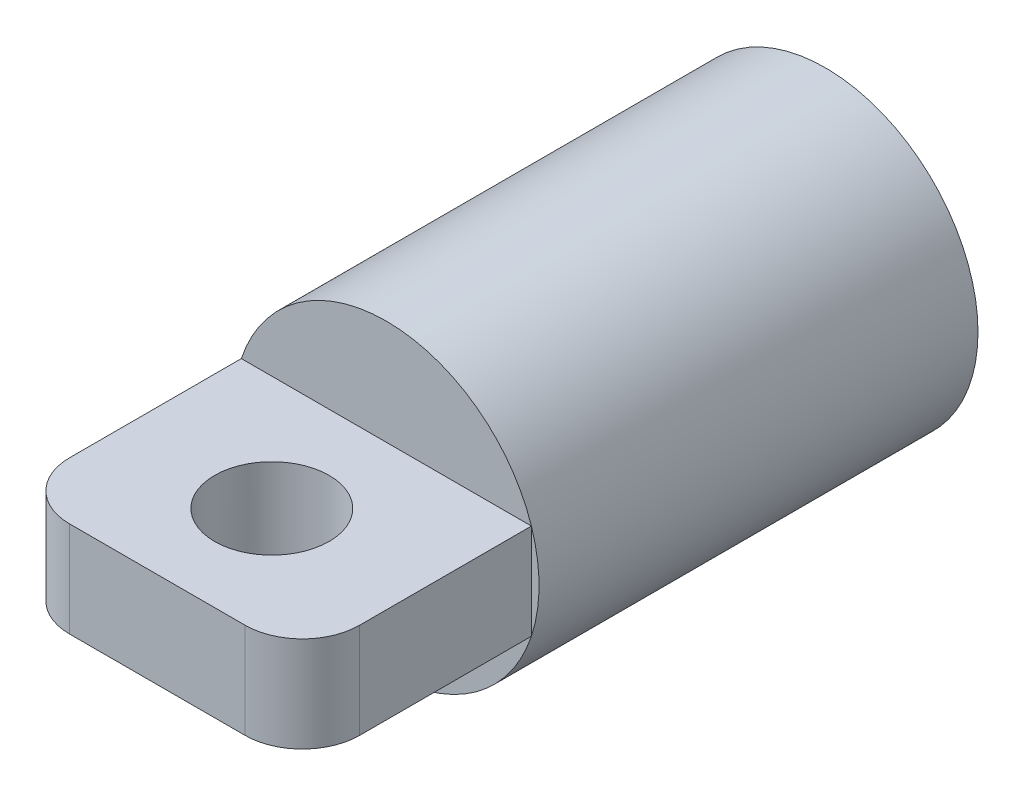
ISO-10303-21;
HEADER;
FILE_DESCRIPTION(('STEP AP214'),'2;1');
FILE_NAME('part.step','',(''),(''),'','','');
FILE_SCHEMA(('AUTOMOTIVE_DESIGN { 1 0 10303 214 1 1 1 1 }'));
ENDSEC;
DATA;
#1=APPLICATION_CONTEXT('core data for automotive mechanical design processes');
#2=APPLICATION_PROTOCOL_DEFINITION('international standard','automotive_design',2000,#1);
#3=PRODUCT_CONTEXT('',#1,'mechanical');
#4=PRODUCT('Part','Part','',(#3));
#5=PRODUCT_RELATED_PRODUCT_CATEGORY('part','',(#4));
#6=PRODUCT_DEFINITION_FORMATION('','',#4);
#7=PRODUCT_DEFINITION_CONTEXT('part definition',#1,'design');
#8=PRODUCT_DEFINITION('design','',#6,#7);
#9=PRODUCT_DEFINITION_SHAPE('','',#8);
#10=(LENGTH_UNIT() NAMED_UNIT(*) SI_UNIT(.MILLI.,.METRE.));
#11=(NAMED_UNIT(*) PLANE_ANGLE_UNIT() SI_UNIT($,.RADIAN.));
#12=(NAMED_UNIT(*) SI_UNIT($,.STERADIAN.) SOLID_ANGLE_UNIT());
#13=UNCERTAINTY_MEASURE_WITH_UNIT(LENGTH_MEASURE(1.E-05),#10,'distance_accuracy_value','');
#14=(GEOMETRIC_REPRESENTATION_CONTEXT(3) GLOBAL_UNCERTAINTY_ASSIGNED_CONTEXT((#13)) GLOBAL_UNIT_ASSIGNED_CONTEXT((#10,
#11,#12)) REPRESENTATION_CONTEXT('',''));
#15=CARTESIAN_POINT('',(0.,0.,0.));
#16=DIRECTION('',(0.,0.,1.));
#17=DIRECTION('',(1.,0.,0.));
#18=AXIS2_PLACEMENT_3D('',#15,#16,#17);
#19=CARTESIAN_POINT('',(0.,0.,35.));
#20=DIRECTION('',(0.,0.,-1.));
#21=DIRECTION('',(-1.,0.,0.));
#22=AXIS2_PLACEMENT_3D('',#19,#20,#21);
#23=CYLINDRICAL_SURFACE('',#22,8.);
#24=CARTESIAN_POINT('',(0.,0.,0.));
#25=DIRECTION('',(0.,0.,1.));
#26=DIRECTION('',(1.,0.,0.));
#27=AXIS2_PLACEMENT_3D('',#24,#25,#26);
#28=CIRCLE('',#27,8.);
#29=CARTESIAN_POINT('',(8.,0.,0.));
#30=VERTEX_POINT('',#29);
#31=EDGE_CURVE('E134',#30,#30,#28,.T.);
#32=ORIENTED_EDGE('',*,*,#31,.T.);
#33=EDGE_LOOP('',(#32));
#34=FACE_BOUND('',#33,.T.);
#35=CARTESIAN_POINT('',(0.,0.,23.));
#36=DIRECTION('',(0.,0.,1.));
#37=DIRECTION('',(1.,0.,0.));
#38=AXIS2_PLACEMENT_3D('',#35,#36,#37);
#39=CIRCLE('',#38,8.);
#40=CARTESIAN_POINT('',(7.59934207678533,2.5,23.));
#41=VERTEX_POINT('',#40);
#42=CARTESIAN_POINT('',(-7.59934207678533,2.5,23.));
#43=VERTEX_POINT('',#42);
#44=EDGE_CURVE('E102',#41,#43,#39,.T.);
#45=ORIENTED_EDGE('',*,*,#44,.F.);
#46=CARTESIAN_POINT('',(7.59934207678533,-2.5,23.));
#47=VERTEX_POINT('',#46);
#48=EDGE_CURVE('E94',#47,#41,#39,.T.);
#49=ORIENTED_EDGE('',*,*,#48,.F.);
#50=CARTESIAN_POINT('',(-7.59934207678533,-2.5,23.));
#51=VERTEX_POINT('',#50);
#52=EDGE_CURVE('E103',#51,#47,#39,.T.);
#53=ORIENTED_EDGE('',*,*,#52,.F.);
#54=EDGE_CURVE('E128',#43,#51,#39,.T.);
#55=ORIENTED_EDGE('',*,*,#54,.F.);
#56=EDGE_LOOP('',(#45,#49,#53,#55));
#57=FACE_BOUND('',#56,.T.);
#58=ADVANCED_FACE('F38',(#34,#57),#23,.T.);
#59=CARTESIAN_POINT('',(0.,0.,0.));
#60=DIRECTION('',(0.,0.,1.));
#61=DIRECTION('',(1.,0.,0.));
#62=AXIS2_PLACEMENT_3D('',#59,#60,#61);
#63=PLANE('',#62);
#64=ORIENTED_EDGE('',*,*,#31,.F.);
#65=EDGE_LOOP('',(#64));
#66=FACE_BOUND('',#65,.T.);
#67=ADVANCED_FACE('F177',(#66),#63,.F.);
#68=CARTESIAN_POINT('',(0.,0.,23.));
#69=DIRECTION('',(0.,0.,1.));
#70=DIRECTION('',(1.,0.,0.));
#71=AXIS2_PLACEMENT_3D('',#68,#69,#70);
#72=PLANE('',#71);
#73=ORIENTED_EDGE('',*,*,#44,.T.);
#74=DIRECTION('',(-1.,0.,0.));
#75=VECTOR('',#74,1.);
#76=CARTESIAN_POINT('',(-7.59934207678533,2.5,23.));
#77=LINE('',#76,#75);
#78=EDGE_CURVE('E112',#41,#43,#77,.T.);
#79=ORIENTED_EDGE('',*,*,#78,.F.);
#80=EDGE_LOOP('',(#73,#79));
#81=FACE_BOUND('',#80,.T.);
#82=ADVANCED_FACE('F119',(#81),#72,.T.);
#83=ORIENTED_EDGE('',*,*,#54,.T.);
#84=DIRECTION('',(0.,-1.,0.));
#85=VECTOR('',#84,1.);
#86=CARTESIAN_POINT('',(-7.59934207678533,-2.5,23.));
#87=LINE('',#86,#85);
#88=EDGE_CURVE('E121',#43,#51,#87,.T.);
#89=ORIENTED_EDGE('',*,*,#88,.F.);
#90=EDGE_LOOP('',(#83,#89));
#91=FACE_BOUND('',#90,.T.);
#92=ADVANCED_FACE('F256',(#91),#72,.T.);
#93=ORIENTED_EDGE('',*,*,#52,.T.);
#94=DIRECTION('',(1.,0.,0.));
#95=VECTOR('',#94,1.);
#96=CARTESIAN_POINT('',(-7.59934207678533,-2.5,23.));
#97=LINE('',#96,#95);
#98=EDGE_CURVE('E116',#51,#47,#97,.T.);
#99=ORIENTED_EDGE('',*,*,#98,.F.);
#100=EDGE_LOOP('',(#93,#99));
#101=FACE_BOUND('',#100,.T.);
#102=ADVANCED_FACE('F248',(#101),#72,.T.);
#103=ORIENTED_EDGE('',*,*,#48,.T.);
#104=DIRECTION('',(0.,1.,0.));
#105=VECTOR('',#104,1.);
#106=CARTESIAN_POINT('',(7.59934207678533,-2.5,23.));
#107=LINE('',#106,#105);
#108=EDGE_CURVE('E98',#47,#41,#107,.T.);
#109=ORIENTED_EDGE('',*,*,#108,.F.);
#110=EDGE_LOOP('',(#103,#109));
#111=FACE_BOUND('',#110,.T.);
#112=ADVANCED_FACE('F96',(#111),#72,.T.);
#113=CARTESIAN_POINT('',(7.59934207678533,-2.5,23.));
#114=DIRECTION('',(1.,0.,0.));
#115=DIRECTION('',(0.,0.,-1.));
#116=AXIS2_PLACEMENT_3D('',#113,#114,#115);
#117=PLANE('',#116);
#118=DIRECTION('',(0.,0.,1.));
#119=VECTOR('',#118,1.);
#120=CARTESIAN_POINT('',(7.59934207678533,2.5,23.));
#121=LINE('',#120,#119);
#122=CARTESIAN_POINT('',(7.59934207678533,2.5,32.));
#123=VERTEX_POINT('',#122);
#124=EDGE_CURVE('E107',#41,#123,#121,.T.);
#125=ORIENTED_EDGE('',*,*,#124,.T.);
#126=DIRECTION('',(0.,1.,0.));
#127=VECTOR('',#126,1.);
#128=CARTESIAN_POINT('',(7.59934207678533,-2.5,32.));
#129=LINE('',#128,#127);
#130=CARTESIAN_POINT('',(7.59934207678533,-2.5,32.));
#131=VERTEX_POINT('',#130);
#132=EDGE_CURVE('E62',#123,#131,#129,.F.);
#133=ORIENTED_EDGE('',*,*,#132,.T.);
#134=DIRECTION('',(0.,0.,1.));
#135=VECTOR('',#134,1.);
#136=CARTESIAN_POINT('',(7.59934207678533,-2.5,23.));
#137=LINE('',#136,#135);
#138=EDGE_CURVE('E124',#47,#131,#137,.T.);
#139=ORIENTED_EDGE('',*,*,#138,.F.);
#140=ORIENTED_EDGE('',*,*,#108,.T.);
#141=EDGE_LOOP('',(#125,#133,#139,#140));
#142=FACE_BOUND('',#141,.T.);
#143=ADVANCED_FACE('F123',(#142),#117,.T.);
#144=CARTESIAN_POINT('',(-7.59934207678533,-2.5,23.));
#145=DIRECTION('',(0.,-1.,0.));
#146=DIRECTION('',(0.,0.,-1.));
#147=AXIS2_PLACEMENT_3D('',#144,#145,#146);
#148=PLANE('',#147);
#149=CARTESIAN_POINT('',(0.,-2.5,29.));
#150=DIRECTION('',(0.,-1.,0.));
#151=DIRECTION('',(0.,0.,-1.));
#152=AXIS2_PLACEMENT_3D('',#149,#150,#151);
#153=CIRCLE('',#152,3.);
#154=CARTESIAN_POINT('',(0.,-2.5,26.));
#155=VERTEX_POINT('',#154);
#156=EDGE_CURVE('E152',#155,#155,#153,.T.);
#157=ORIENTED_EDGE('',*,*,#156,.F.);
#158=EDGE_LOOP('',(#157));
#159=FACE_BOUND('',#158,.T.);
#160=ORIENTED_EDGE('',*,*,#138,.T.);
#161=CARTESIAN_POINT('',(4.59934207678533,-2.5,32.));
#162=DIRECTION('',(0.,-1.,0.));
#163=DIRECTION('',(0.,0.,-1.));
#164=AXIS2_PLACEMENT_3D('',#161,#162,#163);
#165=CIRCLE('',#164,3.);
#166=CARTESIAN_POINT('',(4.59934207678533,-2.5,35.));
#167=VERTEX_POINT('',#166);
#168=EDGE_CURVE('E47',#131,#167,#165,.T.);
#169=ORIENTED_EDGE('',*,*,#168,.T.);
#170=DIRECTION('',(1.,0.,0.));
#171=VECTOR('',#170,1.);
#172=CARTESIAN_POINT('',(-7.59934207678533,-2.5,35.));
#173=LINE('',#172,#171);
#174=CARTESIAN_POINT('',(-4.59934207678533,-2.5,35.));
#175=VERTEX_POINT('',#174);
#176=EDGE_CURVE('E126',#175,#167,#173,.T.);
#177=ORIENTED_EDGE('',*,*,#176,.F.);
#178=CARTESIAN_POINT('',(-4.59934207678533,-2.5,32.));
#179=DIRECTION('',(0.,-1.,0.));
#180=DIRECTION('',(0.,0.,-1.));
#181=AXIS2_PLACEMENT_3D('',#178,#179,#180);
#182=CIRCLE('',#181,3.);
#183=CARTESIAN_POINT('',(-7.59934207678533,-2.5,32.));
#184=VERTEX_POINT('',#183);
#185=EDGE_CURVE('E54',#175,#184,#182,.T.);
#186=ORIENTED_EDGE('',*,*,#185,.T.);
#187=DIRECTION('',(0.,0.,1.));
#188=VECTOR('',#187,1.);
#189=CARTESIAN_POINT('',(-7.59934207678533,-2.5,23.));
#190=LINE('',#189,#188);
#191=EDGE_CURVE('E139',#51,#184,#190,.T.);
#192=ORIENTED_EDGE('',*,*,#191,.F.);
#193=ORIENTED_EDGE('',*,*,#98,.T.);
#194=EDGE_LOOP('',(#160,#169,#177,#186,#192,#193));
#195=FACE_BOUND('',#194,.T.);
#196=ADVANCED_FACE('F172',(#159,#195),#148,.T.);
#197=CARTESIAN_POINT('',(-7.59934207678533,-2.5,23.));
#198=DIRECTION('',(-1.,0.,0.));
#199=DIRECTION('',(0.,0.,1.));
#200=AXIS2_PLACEMENT_3D('',#197,#198,#199);
#201=PLANE('',#200);
#202=ORIENTED_EDGE('',*,*,#191,.T.);
#203=DIRECTION('',(0.,-1.,0.));
#204=VECTOR('',#203,1.);
#205=CARTESIAN_POINT('',(-7.59934207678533,-2.5,32.));
#206=LINE('',#205,#204);
#207=CARTESIAN_POINT('',(-7.59934207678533,2.5,32.));
#208=VERTEX_POINT('',#207);
#209=EDGE_CURVE('E12',#184,#208,#206,.F.);
#210=ORIENTED_EDGE('',*,*,#209,.T.);
#211=DIRECTION('',(0.,0.,1.));
#212=VECTOR('',#211,1.);
#213=CARTESIAN_POINT('',(-7.59934207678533,2.5,23.));
#214=LINE('',#213,#212);
#215=EDGE_CURVE('E115',#43,#208,#214,.T.);
#216=ORIENTED_EDGE('',*,*,#215,.F.);
#217=ORIENTED_EDGE('',*,*,#88,.T.);
#218=EDGE_LOOP('',(#202,#210,#216,#217));
#219=FACE_BOUND('',#218,.T.);
#220=ADVANCED_FACE('F163',(#219),#201,.T.);
#221=CARTESIAN_POINT('',(-7.59934207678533,2.5,23.));
#222=DIRECTION('',(0.,1.,0.));
#223=DIRECTION('',(0.,0.,1.));
#224=AXIS2_PLACEMENT_3D('',#221,#222,#223);
#225=PLANE('',#224);
#226=CARTESIAN_POINT('',(0.,2.5,29.));
#227=DIRECTION('',(0.,1.,0.));
#228=DIRECTION('',(0.,0.,1.));
#229=AXIS2_PLACEMENT_3D('',#226,#227,#228);
#230=CIRCLE('',#229,3.);
#231=CARTESIAN_POINT('',(0.,2.5,32.));
#232=VERTEX_POINT('',#231);
#233=EDGE_CURVE('E42',#232,#232,#230,.T.);
#234=ORIENTED_EDGE('',*,*,#233,.F.);
#235=EDGE_LOOP('',(#234));
#236=FACE_BOUND('',#235,.T.);
#237=DIRECTION('',(-1.,0.,0.));
#238=VECTOR('',#237,1.);
#239=CARTESIAN_POINT('',(-7.59934207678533,2.5,35.));
#240=LINE('',#239,#238);
#241=CARTESIAN_POINT('',(4.59934207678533,2.5,35.));
#242=VERTEX_POINT('',#241);
#243=CARTESIAN_POINT('',(-4.59934207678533,2.5,35.));
#244=VERTEX_POINT('',#243);
#245=EDGE_CURVE('E146',#242,#244,#240,.T.);
#246=ORIENTED_EDGE('',*,*,#245,.F.);
#247=CARTESIAN_POINT('',(4.59934207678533,2.5,32.));
#248=DIRECTION('',(0.,1.,0.));
#249=DIRECTION('',(0.,0.,1.));
#250=AXIS2_PLACEMENT_3D('',#247,#248,#249);
#251=CIRCLE('',#250,3.);
#252=EDGE_CURVE('E114',#242,#123,#251,.T.);
#253=ORIENTED_EDGE('',*,*,#252,.T.);
#254=ORIENTED_EDGE('',*,*,#124,.F.);
#255=ORIENTED_EDGE('',*,*,#78,.T.);
#256=ORIENTED_EDGE('',*,*,#215,.T.);
#257=CARTESIAN_POINT('',(-4.59934207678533,2.5,32.));
#258=DIRECTION('',(0.,1.,0.));
#259=DIRECTION('',(0.,0.,1.));
#260=AXIS2_PLACEMENT_3D('',#257,#258,#259);
#261=CIRCLE('',#260,3.);
#262=EDGE_CURVE('E198',#208,#244,#261,.T.);
#263=ORIENTED_EDGE('',*,*,#262,.T.);
#264=EDGE_LOOP('',(#246,#253,#254,#255,#256,#263));
#265=FACE_BOUND('',#264,.T.);
#266=ADVANCED_FACE('F110',(#236,#265),#225,.T.);
#267=CARTESIAN_POINT('',(0.,0.,35.));
#268=DIRECTION('',(0.,0.,1.));
#269=DIRECTION('',(1.,0.,0.));
#270=AXIS2_PLACEMENT_3D('',#267,#268,#269);
#271=PLANE('',#270);
#272=ORIENTED_EDGE('',*,*,#176,.T.);
#273=DIRECTION('',(0.,1.,0.));
#274=VECTOR('',#273,1.);
#275=CARTESIAN_POINT('',(4.59934207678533,0.,35.));
#276=LINE('',#275,#274);
#277=EDGE_CURVE('E131',#167,#242,#276,.T.);
#278=ORIENTED_EDGE('',*,*,#277,.T.);
#279=ORIENTED_EDGE('',*,*,#245,.T.);
#280=DIRECTION('',(0.,-1.,0.));
#281=VECTOR('',#280,1.);
#282=CARTESIAN_POINT('',(-4.59934207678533,0.,35.));
#283=LINE('',#282,#281);
#284=EDGE_CURVE('E129',#244,#175,#283,.T.);
#285=ORIENTED_EDGE('',*,*,#284,.T.);
#286=EDGE_LOOP('',(#272,#278,#279,#285));
#287=FACE_BOUND('',#286,.T.);
#288=ADVANCED_FACE('F162',(#287),#271,.T.);
#289=CARTESIAN_POINT('',(4.59934207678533,0.,32.));
#290=DIRECTION('',(0.,1.,0.));
#291=DIRECTION('',(0.,0.,1.));
#292=AXIS2_PLACEMENT_3D('',#289,#290,#291);
#293=CYLINDRICAL_SURFACE('',#292,3.);
#294=ORIENTED_EDGE('',*,*,#168,.F.);
#295=ORIENTED_EDGE('',*,*,#132,.F.);
#296=ORIENTED_EDGE('',*,*,#252,.F.);
#297=ORIENTED_EDGE('',*,*,#277,.F.);
#298=EDGE_LOOP('',(#294,#295,#296,#297));
#299=FACE_BOUND('',#298,.T.);
#300=ADVANCED_FACE('F169',(#299),#293,.T.);
#301=CARTESIAN_POINT('',(-4.59934207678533,0.,32.));
#302=DIRECTION('',(0.,-1.,0.));
#303=DIRECTION('',(0.,0.,-1.));
#304=AXIS2_PLACEMENT_3D('',#301,#302,#303);
#305=CYLINDRICAL_SURFACE('',#304,3.);
#306=ORIENTED_EDGE('',*,*,#262,.F.);
#307=ORIENTED_EDGE('',*,*,#209,.F.);
#308=ORIENTED_EDGE('',*,*,#185,.F.);
#309=ORIENTED_EDGE('',*,*,#284,.F.);
#310=EDGE_LOOP('',(#306,#307,#308,#309));
#311=FACE_BOUND('',#310,.T.);
#312=ADVANCED_FACE('F40',(#311),#305,.T.);
#313=CARTESIAN_POINT('',(0.,5.5,29.));
#314=DIRECTION('',(0.,-1.,0.));
#315=DIRECTION('',(0.,0.,-1.));
#316=AXIS2_PLACEMENT_3D('',#313,#314,#315);
#317=CYLINDRICAL_SURFACE('',#316,3.);
#318=ORIENTED_EDGE('',*,*,#233,.T.);
#319=EDGE_LOOP('',(#318));
#320=FACE_BOUND('',#319,.T.);
#321=ORIENTED_EDGE('',*,*,#156,.T.);
#322=EDGE_LOOP('',(#321));
#323=FACE_BOUND('',#322,.T.);
#324=ADVANCED_FACE('F159',(#320,#323),#317,.F.);
#325=CLOSED_SHELL('',(#58,#67,#82,#92,#102,#112,#143,#196,#220,#266,#288,#300,#312,#324));
#326=MANIFOLD_SOLID_BREP('B2',#325);
#327=ADVANCED_BREP_SHAPE_REPRESENTATION('',(#18,#326),#14);
#328=SHAPE_DEFINITION_REPRESENTATION(#9,#327);
ENDSEC;
END-ISO-10303-21;
